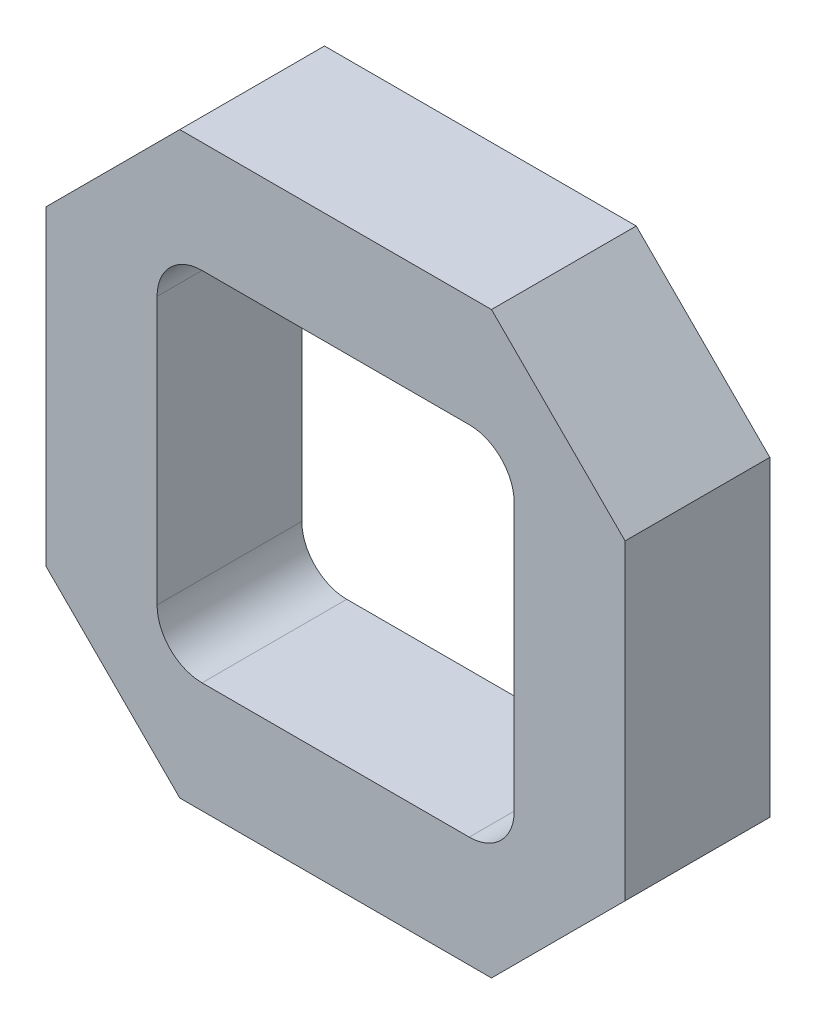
from build123d import *

# Parameters (mm, degrees)
SKETCH2_W           = 330.2
SKETCH2_H           = 330.2
BOSS_EXTRUDE1_DEPTH = 101.6
CHAMFER1_SIZE       = 76.2
SKETCH21_W          = 521.081229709
SKETCH21_H          = 420.250539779
CUT_EXTRUDE16_DEPTH = 19.05


with BuildPart() as part:
    # Sketch2 → Boss-Extrude1 (new body)
    with BuildSketch(Plane(origin=(0, 0, 0), x_dir=(0, 1, 0), z_dir=(0, 0, 1))):
        Rectangle(SKETCH2_W, SKETCH2_H)
        with BuildLine():
            Line((-101.854, 76.2), (-101.854, -76.2))
            ThreePointArc((-101.854, -76.2), (-94.340117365, -94.340117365), (-76.2, -101.854))
            Line((-76.2, -101.854), (76.2, -101.854))
            ThreePointArc((76.2, -101.854), (94.340117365, -94.340117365), (101.854, -76.2))
            Line((101.854, -76.2), (101.854, 76.2))
            ThreePointArc((101.854, 76.2), (94.340117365, 94.340117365), (76.2, 101.854))
            Line((76.2, 101.854), (-76.2, 101.854))
            ThreePointArc((-76.2, 101.854), (-94.340117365, 94.340117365), (-101.854, 76.2))
        make_face(mode=Mode.SUBTRACT)
    extrude(amount=BOSS_EXTRUDE1_DEPTH)

    # Chamfer1
    chamfer1_edges = [part.edges().sort_by_distance(p)[0] for p in [
        (165.1, 165.1, 50.8),
        (165.1, -165.1, 50.8),
        (-165.1, -165.1, 50.8),
        (-165.1, 165.1, 50.8),
    ]]
    chamfer(chamfer1_edges, length=CHAMFER1_SIZE)

    # Sketch21 → Cut-Extrude16 (cut)
    with BuildSketch(Plane(origin=(0, 0, 0), x_dir=(1, 0, 0), z_dir=(0, 0, -1))):
        with Locations((12.291039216, -5.548793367)):
            Rectangle(SKETCH21_W, SKETCH21_H)
    extrude(amount=-CUT_EXTRUDE16_DEPTH, mode=Mode.SUBTRACT)


solid = part.part
